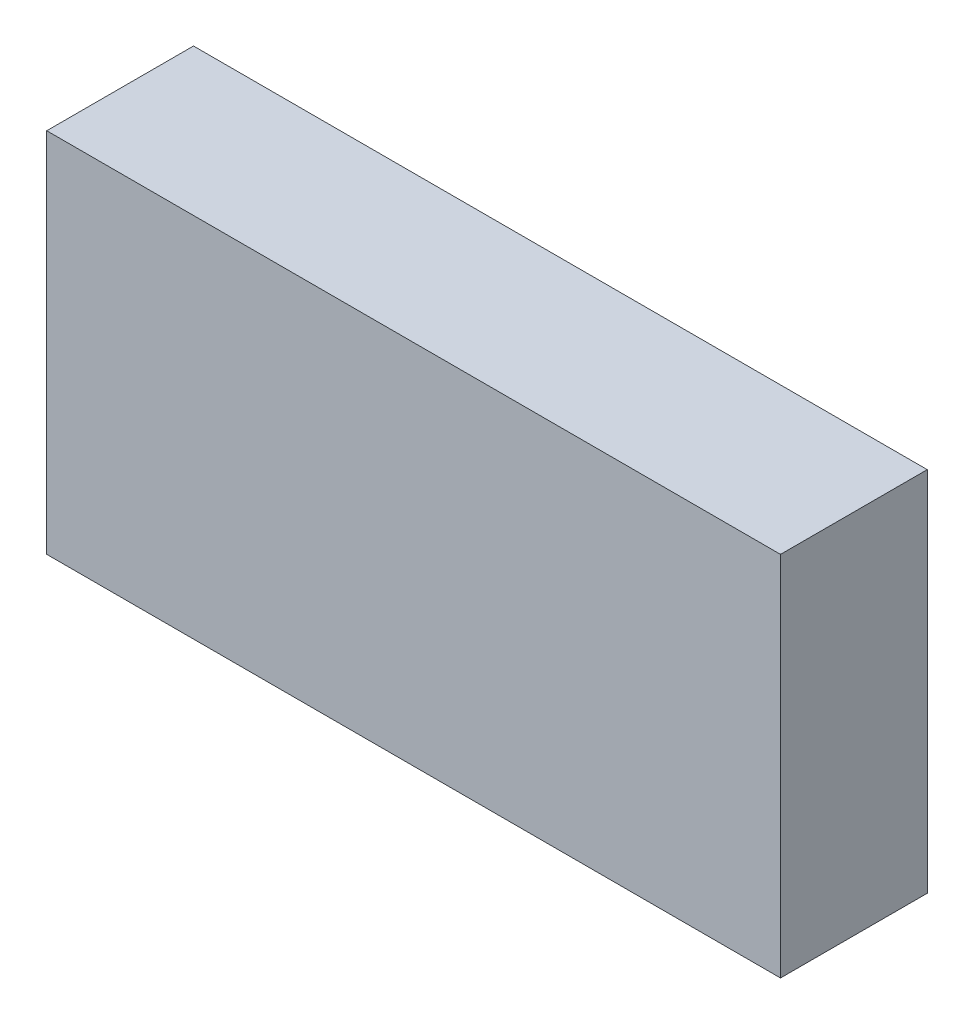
from build123d import *

# Parameters (mm, degrees)
SKIZZE1_W                       = 50
SKIZZE1_H                       = 25
AUFSATZ_LINEAR_AUSTRAGEN1_DEPTH = 10


with BuildPart() as part:
    # Skizze1 → Aufsatz-Linear austragen1 (new body)
    with BuildSketch(Plane.XY):
        with Locations((25, 12.5)):
            Rectangle(SKIZZE1_W, SKIZZE1_H)
    extrude(amount=AUFSATZ_LINEAR_AUSTRAGEN1_DEPTH)


solid = part.part
